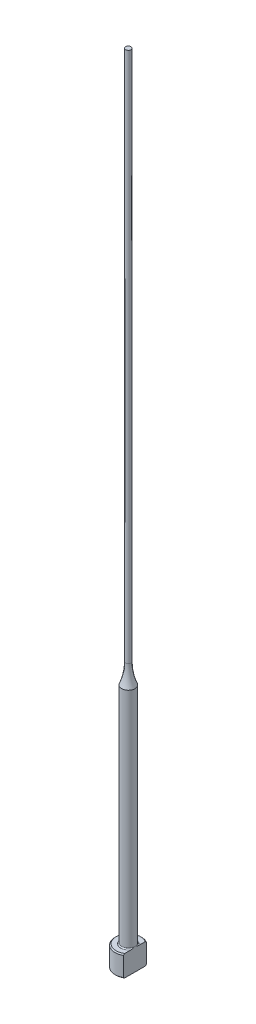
from build123d import *
from build123d.topology import SkipClean

# Parameters (mm, degrees)
CHAMFER1_SIZE    = 0.2
FILLET1_R        = 0.2
KEYED_HEAD_DEPTH = 151.041660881


with BuildPart() as part:
    # Sketch1 → Revolve1 (revolve)
    with BuildSketch(Plane.XY, mode=Mode.PRIVATE) as revolve1_sk:
        with BuildLine():
            Line((0, 0), (-2.5, 0))
            Line((-2.5, 0), (-2.5, 4))
            Line((-2.5, 4), (-1.25, 4))
            Line((-1.25, 4), (-1.25, 46.200328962))
            ThreePointArc((-1.25, 46.200328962), (-0.689291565, 48.063508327), (-0.5, 50))
            Line((-0.5, 50), (-0.5, 150))
            Line((-0.5, 150), (0, 150))
            Line((0, 150), (0, 0))
        make_face()
    revolve(revolve1_sk.sketch.rotate(Axis((0, 259.958771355, 0), (0, -1, 0)), 270), axis=Axis((0, 259.958771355, 0), (0, -1, 0)))

    # Chamfer1
    chamfer1_edges = [part.edges().sort_by_distance(p)[0] for p in [
        (0, 0, -2.5),
        (0, 4, -2.5),
    ]]
    chamfer(chamfer1_edges, length=CHAMFER1_SIZE)

    # Fillet1
    fillet1_edges = [part.edges().sort_by_distance(p)[0] for p in [
        (0, 4, -1.25),
    ]]
    fillet(fillet1_edges, radius=FILLET1_R)

    # Sketch2 → Keyed Head (cut, through all)
    with SkipClean():  # the faces are left unmerged after this step: merging them gives an invalid solid
        with BuildSketch(Plane(origin=(0, 0, 0), x_dir=(1, 0, 0), z_dir=(0, 1, 0))):
            with BuildLine():
                Line((1.25, -2.165063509), (1.25, 2.165063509))
                ThreePointArc((1.25, 2.165063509), (2.5, 0), (1.25, -2.165063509))
            make_face()
        extrude(amount=KEYED_HEAD_DEPTH, mode=Mode.SUBTRACT)


solid = part.part
